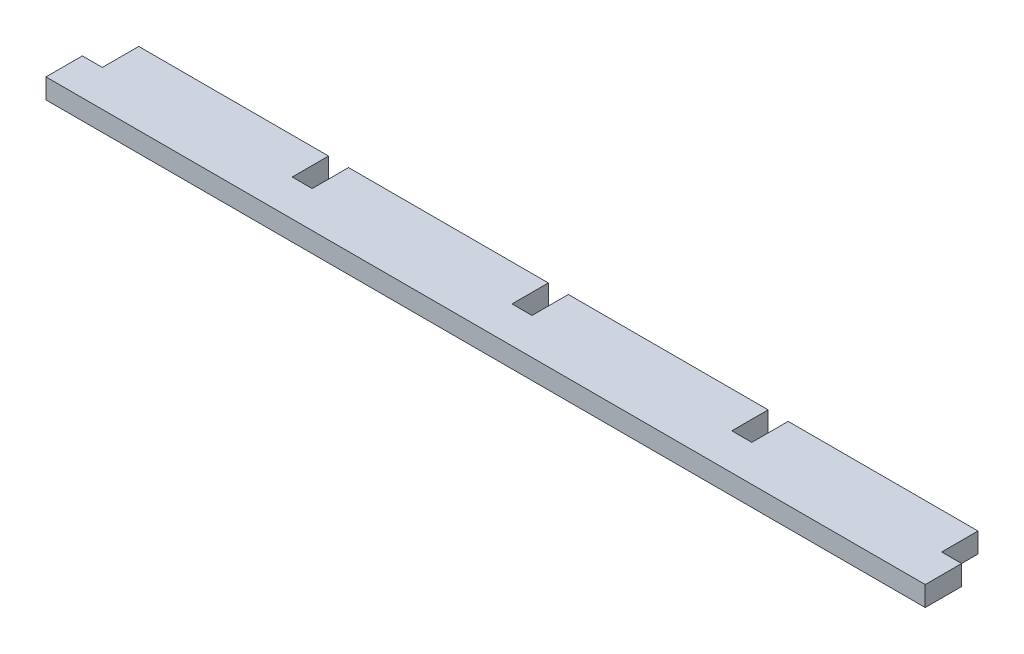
ISO-10303-21;
HEADER;
FILE_DESCRIPTION(('STEP AP214'),'2;1');
FILE_NAME('part.step','',(''),(''),'','','');
FILE_SCHEMA(('AUTOMOTIVE_DESIGN { 1 0 10303 214 1 1 1 1 }'));
ENDSEC;
DATA;
#1=APPLICATION_CONTEXT('core data for automotive mechanical design processes');
#2=APPLICATION_PROTOCOL_DEFINITION('international standard','automotive_design',2000,#1);
#3=PRODUCT_CONTEXT('',#1,'mechanical');
#4=PRODUCT('Part','Part','',(#3));
#5=PRODUCT_RELATED_PRODUCT_CATEGORY('part','',(#4));
#6=PRODUCT_DEFINITION_FORMATION('','',#4);
#7=PRODUCT_DEFINITION_CONTEXT('part definition',#1,'design');
#8=PRODUCT_DEFINITION('design','',#6,#7);
#9=PRODUCT_DEFINITION_SHAPE('','',#8);
#10=(LENGTH_UNIT() NAMED_UNIT(*) SI_UNIT(.MILLI.,.METRE.));
#11=(NAMED_UNIT(*) PLANE_ANGLE_UNIT() SI_UNIT($,.RADIAN.));
#12=(NAMED_UNIT(*) SI_UNIT($,.STERADIAN.) SOLID_ANGLE_UNIT());
#13=UNCERTAINTY_MEASURE_WITH_UNIT(LENGTH_MEASURE(1.E-05),#10,'distance_accuracy_value','');
#14=(GEOMETRIC_REPRESENTATION_CONTEXT(3) GLOBAL_UNCERTAINTY_ASSIGNED_CONTEXT((#13)) GLOBAL_UNIT_ASSIGNED_CONTEXT((#10,
#11,#12)) REPRESENTATION_CONTEXT('',''));
#15=CARTESIAN_POINT('',(0.,0.,0.));
#16=DIRECTION('',(0.,0.,1.));
#17=DIRECTION('',(1.,0.,0.));
#18=AXIS2_PLACEMENT_3D('',#15,#16,#17);
#19=CARTESIAN_POINT('',(-6.35,6.35,0.));
#20=DIRECTION('',(1.,0.,0.));
#21=DIRECTION('',(0.,0.,-1.));
#22=AXIS2_PLACEMENT_3D('',#19,#20,#21);
#23=PLANE('',#22);
#24=DIRECTION('',(0.,0.,1.));
#25=VECTOR('',#24,1.);
#26=CARTESIAN_POINT('',(-6.35,0.,0.));
#27=LINE('',#26,#25);
#28=CARTESIAN_POINT('',(-6.35,0.,-23.114));
#29=VERTEX_POINT('',#28);
#30=CARTESIAN_POINT('',(-6.35,0.,-11.557));
#31=VERTEX_POINT('',#30);
#32=EDGE_CURVE('E202',#29,#31,#27,.T.);
#33=ORIENTED_EDGE('',*,*,#32,.F.);
#34=DIRECTION('',(0.,-1.,0.));
#35=VECTOR('',#34,1.);
#36=CARTESIAN_POINT('',(-6.35,6.35,-23.114));
#37=LINE('',#36,#35);
#38=CARTESIAN_POINT('',(-6.35,6.35,-23.114));
#39=VERTEX_POINT('',#38);
#40=EDGE_CURVE('E11',#39,#29,#37,.T.);
#41=ORIENTED_EDGE('',*,*,#40,.F.);
#42=DIRECTION('',(0.,0.,1.));
#43=VECTOR('',#42,1.);
#44=CARTESIAN_POINT('',(-6.35,6.35,0.));
#45=LINE('',#44,#43);
#46=CARTESIAN_POINT('',(-6.35,6.35,-11.557));
#47=VERTEX_POINT('',#46);
#48=EDGE_CURVE('E250',#39,#47,#45,.T.);
#49=ORIENTED_EDGE('',*,*,#48,.T.);
#50=DIRECTION('',(0.,-1.,0.));
#51=VECTOR('',#50,1.);
#52=CARTESIAN_POINT('',(-6.35,6.35,-11.557));
#53=LINE('',#52,#51);
#54=EDGE_CURVE('E121',#47,#31,#53,.T.);
#55=ORIENTED_EDGE('',*,*,#54,.T.);
#56=EDGE_LOOP('',(#33,#41,#49,#55));
#57=FACE_BOUND('',#56,.T.);
#58=ADVANCED_FACE('F35',(#57),#23,.T.);
#59=CARTESIAN_POINT('',(0.,6.35,-23.114));
#60=DIRECTION('',(0.,0.,1.));
#61=DIRECTION('',(1.,0.,0.));
#62=AXIS2_PLACEMENT_3D('',#59,#60,#61);
#63=PLANE('',#62);
#64=DIRECTION('',(-1.,0.,0.));
#65=VECTOR('',#64,1.);
#66=CARTESIAN_POINT('',(0.,0.,-23.114));
#67=LINE('',#66,#65);
#68=CARTESIAN_POINT('',(-66.675,0.,-23.114));
#69=VERTEX_POINT('',#68);
#70=EDGE_CURVE('E205',#29,#69,#67,.T.);
#71=ORIENTED_EDGE('',*,*,#70,.T.);
#72=DIRECTION('',(0.,-1.,0.));
#73=VECTOR('',#72,1.);
#74=CARTESIAN_POINT('',(-66.675,6.35,-23.114));
#75=LINE('',#74,#73);
#76=CARTESIAN_POINT('',(-66.675,6.35,-23.114));
#77=VERTEX_POINT('',#76);
#78=EDGE_CURVE('E43',#77,#69,#75,.T.);
#79=ORIENTED_EDGE('',*,*,#78,.F.);
#80=DIRECTION('',(-1.,0.,0.));
#81=VECTOR('',#80,1.);
#82=CARTESIAN_POINT('',(0.,6.35,-23.114));
#83=LINE('',#82,#81);
#84=EDGE_CURVE('E310',#39,#77,#83,.T.);
#85=ORIENTED_EDGE('',*,*,#84,.F.);
#86=ORIENTED_EDGE('',*,*,#40,.T.);
#87=EDGE_LOOP('',(#71,#79,#85,#86));
#88=FACE_BOUND('',#87,.T.);
#89=ADVANCED_FACE('F399',(#88),#63,.F.);
#90=CARTESIAN_POINT('',(-66.675,6.35,0.));
#91=DIRECTION('',(1.,0.,0.));
#92=DIRECTION('',(0.,0.,-1.));
#93=AXIS2_PLACEMENT_3D('',#90,#91,#92);
#94=PLANE('',#93);
#95=DIRECTION('',(0.,0.,1.));
#96=VECTOR('',#95,1.);
#97=CARTESIAN_POINT('',(-66.675,0.,0.));
#98=LINE('',#97,#96);
#99=CARTESIAN_POINT('',(-66.675,0.,-11.557));
#100=VERTEX_POINT('',#99);
#101=EDGE_CURVE('E207',#69,#100,#98,.T.);
#102=ORIENTED_EDGE('',*,*,#101,.T.);
#103=DIRECTION('',(0.,-1.,0.));
#104=VECTOR('',#103,1.);
#105=CARTESIAN_POINT('',(-66.675,6.35,-11.557));
#106=LINE('',#105,#104);
#107=CARTESIAN_POINT('',(-66.675,6.35,-11.557));
#108=VERTEX_POINT('',#107);
#109=EDGE_CURVE('E283',#108,#100,#106,.T.);
#110=ORIENTED_EDGE('',*,*,#109,.F.);
#111=DIRECTION('',(0.,0.,1.));
#112=VECTOR('',#111,1.);
#113=CARTESIAN_POINT('',(-66.675,6.35,0.));
#114=LINE('',#113,#112);
#115=EDGE_CURVE('E291',#77,#108,#114,.T.);
#116=ORIENTED_EDGE('',*,*,#115,.F.);
#117=ORIENTED_EDGE('',*,*,#78,.T.);
#118=EDGE_LOOP('',(#102,#110,#116,#117));
#119=FACE_BOUND('',#118,.T.);
#120=ADVANCED_FACE('F289',(#119),#94,.F.);
#121=CARTESIAN_POINT('',(0.,6.35,-11.557));
#122=DIRECTION('',(0.,0.,-1.));
#123=DIRECTION('',(-1.,0.,0.));
#124=AXIS2_PLACEMENT_3D('',#121,#122,#123);
#125=PLANE('',#124);
#126=DIRECTION('',(1.,0.,0.));
#127=VECTOR('',#126,1.);
#128=CARTESIAN_POINT('',(0.,0.,-11.557));
#129=LINE('',#128,#127);
#130=CARTESIAN_POINT('',(-73.025,0.,-11.557));
#131=VERTEX_POINT('',#130);
#132=EDGE_CURVE('E212',#131,#100,#129,.T.);
#133=ORIENTED_EDGE('',*,*,#132,.F.);
#134=DIRECTION('',(0.,-1.,0.));
#135=VECTOR('',#134,1.);
#136=CARTESIAN_POINT('',(-73.025,6.35,-11.557));
#137=LINE('',#136,#135);
#138=CARTESIAN_POINT('',(-73.025,6.35,-11.557));
#139=VERTEX_POINT('',#138);
#140=EDGE_CURVE('E281',#139,#131,#137,.T.);
#141=ORIENTED_EDGE('',*,*,#140,.F.);
#142=DIRECTION('',(1.,0.,0.));
#143=VECTOR('',#142,1.);
#144=CARTESIAN_POINT('',(0.,6.35,-11.557));
#145=LINE('',#144,#143);
#146=EDGE_CURVE('E303',#139,#108,#145,.T.);
#147=ORIENTED_EDGE('',*,*,#146,.T.);
#148=ORIENTED_EDGE('',*,*,#109,.T.);
#149=EDGE_LOOP('',(#133,#141,#147,#148));
#150=FACE_BOUND('',#149,.T.);
#151=ADVANCED_FACE('F300',(#150),#125,.T.);
#152=CARTESIAN_POINT('',(-73.025,6.35,0.));
#153=DIRECTION('',(1.,0.,0.));
#154=DIRECTION('',(0.,0.,-1.));
#155=AXIS2_PLACEMENT_3D('',#152,#153,#154);
#156=PLANE('',#155);
#157=DIRECTION('',(0.,0.,1.));
#158=VECTOR('',#157,1.);
#159=CARTESIAN_POINT('',(-73.025,0.,0.));
#160=LINE('',#159,#158);
#161=CARTESIAN_POINT('',(-73.025,0.,-23.114));
#162=VERTEX_POINT('',#161);
#163=EDGE_CURVE('E215',#162,#131,#160,.T.);
#164=ORIENTED_EDGE('',*,*,#163,.F.);
#165=DIRECTION('',(0.,-1.,0.));
#166=VECTOR('',#165,1.);
#167=CARTESIAN_POINT('',(-73.025,6.35,-23.114));
#168=LINE('',#167,#166);
#169=CARTESIAN_POINT('',(-73.025,6.35,-23.114));
#170=VERTEX_POINT('',#169);
#171=EDGE_CURVE('E279',#170,#162,#168,.T.);
#172=ORIENTED_EDGE('',*,*,#171,.F.);
#173=DIRECTION('',(0.,0.,1.));
#174=VECTOR('',#173,1.);
#175=CARTESIAN_POINT('',(-73.025,6.35,0.));
#176=LINE('',#175,#174);
#177=EDGE_CURVE('E306',#170,#139,#176,.T.);
#178=ORIENTED_EDGE('',*,*,#177,.T.);
#179=ORIENTED_EDGE('',*,*,#140,.T.);
#180=EDGE_LOOP('',(#164,#172,#178,#179));
#181=FACE_BOUND('',#180,.T.);
#182=ADVANCED_FACE('F409',(#181),#156,.T.);
#183=CARTESIAN_POINT('',(-136.525,0.,-23.114));
#184=VERTEX_POINT('',#183);
#185=EDGE_CURVE('E209',#162,#184,#67,.T.);
#186=ORIENTED_EDGE('',*,*,#185,.T.);
#187=DIRECTION('',(0.,-1.,0.));
#188=VECTOR('',#187,1.);
#189=CARTESIAN_POINT('',(-136.525,6.35,-23.114));
#190=LINE('',#189,#188);
#191=CARTESIAN_POINT('',(-136.525,6.35,-23.114));
#192=VERTEX_POINT('',#191);
#193=EDGE_CURVE('E276',#192,#184,#190,.T.);
#194=ORIENTED_EDGE('',*,*,#193,.F.);
#195=EDGE_CURVE('E308',#170,#192,#83,.T.);
#196=ORIENTED_EDGE('',*,*,#195,.F.);
#197=ORIENTED_EDGE('',*,*,#171,.T.);
#198=EDGE_LOOP('',(#186,#194,#196,#197));
#199=FACE_BOUND('',#198,.T.);
#200=ADVANCED_FACE('F377',(#199),#63,.F.);
#201=CARTESIAN_POINT('',(-136.525,6.35,0.));
#202=DIRECTION('',(1.,0.,0.));
#203=DIRECTION('',(0.,0.,-1.));
#204=AXIS2_PLACEMENT_3D('',#201,#202,#203);
#205=PLANE('',#204);
#206=DIRECTION('',(0.,0.,1.));
#207=VECTOR('',#206,1.);
#208=CARTESIAN_POINT('',(-136.525,0.,0.));
#209=LINE('',#208,#207);
#210=CARTESIAN_POINT('',(-136.525,0.,-11.557));
#211=VERTEX_POINT('',#210);
#212=EDGE_CURVE('E218',#184,#211,#209,.T.);
#213=ORIENTED_EDGE('',*,*,#212,.T.);
#214=DIRECTION('',(0.,-1.,0.));
#215=VECTOR('',#214,1.);
#216=CARTESIAN_POINT('',(-136.525,6.35,-11.557));
#217=LINE('',#216,#215);
#218=CARTESIAN_POINT('',(-136.525,6.35,-11.557));
#219=VERTEX_POINT('',#218);
#220=EDGE_CURVE('E274',#219,#211,#217,.T.);
#221=ORIENTED_EDGE('',*,*,#220,.F.);
#222=DIRECTION('',(0.,0.,1.));
#223=VECTOR('',#222,1.);
#224=CARTESIAN_POINT('',(-136.525,6.35,0.));
#225=LINE('',#224,#223);
#226=EDGE_CURVE('E314',#192,#219,#225,.T.);
#227=ORIENTED_EDGE('',*,*,#226,.F.);
#228=ORIENTED_EDGE('',*,*,#193,.T.);
#229=EDGE_LOOP('',(#213,#221,#227,#228));
#230=FACE_BOUND('',#229,.T.);
#231=ADVANCED_FACE('F381',(#230),#205,.F.);
#232=CARTESIAN_POINT('',(0.,6.35,-11.557));
#233=DIRECTION('',(0.,0.,-1.));
#234=DIRECTION('',(-1.,0.,0.));
#235=AXIS2_PLACEMENT_3D('',#232,#233,#234);
#236=PLANE('',#235);
#237=DIRECTION('',(1.,0.,0.));
#238=VECTOR('',#237,1.);
#239=CARTESIAN_POINT('',(0.,0.,-11.557));
#240=LINE('',#239,#238);
#241=CARTESIAN_POINT('',(-142.875,0.,-11.557));
#242=VERTEX_POINT('',#241);
#243=EDGE_CURVE('E221',#242,#211,#240,.T.);
#244=ORIENTED_EDGE('',*,*,#243,.F.);
#245=DIRECTION('',(0.,-1.,0.));
#246=VECTOR('',#245,1.);
#247=CARTESIAN_POINT('',(-142.875,6.35,-11.557));
#248=LINE('',#247,#246);
#249=CARTESIAN_POINT('',(-142.875,6.35,-11.557));
#250=VERTEX_POINT('',#249);
#251=EDGE_CURVE('E272',#250,#242,#248,.T.);
#252=ORIENTED_EDGE('',*,*,#251,.F.);
#253=DIRECTION('',(1.,0.,0.));
#254=VECTOR('',#253,1.);
#255=CARTESIAN_POINT('',(0.,6.35,-11.557));
#256=LINE('',#255,#254);
#257=EDGE_CURVE('E316',#250,#219,#256,.T.);
#258=ORIENTED_EDGE('',*,*,#257,.T.);
#259=ORIENTED_EDGE('',*,*,#220,.T.);
#260=EDGE_LOOP('',(#244,#252,#258,#259));
#261=FACE_BOUND('',#260,.T.);
#262=ADVANCED_FACE('F386',(#261),#236,.T.);
#263=CARTESIAN_POINT('',(-142.875,6.35,0.));
#264=DIRECTION('',(1.,0.,0.));
#265=DIRECTION('',(0.,0.,-1.));
#266=AXIS2_PLACEMENT_3D('',#263,#264,#265);
#267=PLANE('',#266);
#268=DIRECTION('',(0.,0.,1.));
#269=VECTOR('',#268,1.);
#270=CARTESIAN_POINT('',(-142.875,0.,0.));
#271=LINE('',#270,#269);
#272=CARTESIAN_POINT('',(-142.875,0.,-23.114));
#273=VERTEX_POINT('',#272);
#274=EDGE_CURVE('E224',#273,#242,#271,.T.);
#275=ORIENTED_EDGE('',*,*,#274,.F.);
#276=DIRECTION('',(0.,-1.,0.));
#277=VECTOR('',#276,1.);
#278=CARTESIAN_POINT('',(-142.875,6.35,-23.114));
#279=LINE('',#278,#277);
#280=CARTESIAN_POINT('',(-142.875,6.35,-23.114));
#281=VERTEX_POINT('',#280);
#282=EDGE_CURVE('E270',#281,#273,#279,.T.);
#283=ORIENTED_EDGE('',*,*,#282,.F.);
#284=DIRECTION('',(0.,0.,1.));
#285=VECTOR('',#284,1.);
#286=CARTESIAN_POINT('',(-142.875,6.35,0.));
#287=LINE('',#286,#285);
#288=EDGE_CURVE('E319',#281,#250,#287,.T.);
#289=ORIENTED_EDGE('',*,*,#288,.T.);
#290=ORIENTED_EDGE('',*,*,#251,.T.);
#291=EDGE_LOOP('',(#275,#283,#289,#290));
#292=FACE_BOUND('',#291,.T.);
#293=ADVANCED_FACE('F388',(#292),#267,.T.);
#294=CARTESIAN_POINT('',(-206.375,0.,-23.114));
#295=VERTEX_POINT('',#294);
#296=EDGE_CURVE('E227',#273,#295,#67,.T.);
#297=ORIENTED_EDGE('',*,*,#296,.T.);
#298=DIRECTION('',(0.,-1.,0.));
#299=VECTOR('',#298,1.);
#300=CARTESIAN_POINT('',(-206.375,6.35,-23.114));
#301=LINE('',#300,#299);
#302=CARTESIAN_POINT('',(-206.375,6.35,-23.114));
#303=VERTEX_POINT('',#302);
#304=EDGE_CURVE('E267',#303,#295,#301,.T.);
#305=ORIENTED_EDGE('',*,*,#304,.F.);
#306=EDGE_CURVE('E322',#281,#303,#83,.T.);
#307=ORIENTED_EDGE('',*,*,#306,.F.);
#308=ORIENTED_EDGE('',*,*,#282,.T.);
#309=EDGE_LOOP('',(#297,#305,#307,#308));
#310=FACE_BOUND('',#309,.T.);
#311=ADVANCED_FACE('F356',(#310),#63,.F.);
#312=CARTESIAN_POINT('',(-206.375,6.35,0.));
#313=DIRECTION('',(1.,0.,0.));
#314=DIRECTION('',(0.,0.,-1.));
#315=AXIS2_PLACEMENT_3D('',#312,#313,#314);
#316=PLANE('',#315);
#317=DIRECTION('',(0.,0.,1.));
#318=VECTOR('',#317,1.);
#319=CARTESIAN_POINT('',(-206.375,0.,0.));
#320=LINE('',#319,#318);
#321=CARTESIAN_POINT('',(-206.375,0.,-11.557));
#322=VERTEX_POINT('',#321);
#323=EDGE_CURVE('E228',#295,#322,#320,.T.);
#324=ORIENTED_EDGE('',*,*,#323,.T.);
#325=DIRECTION('',(0.,-1.,0.));
#326=VECTOR('',#325,1.);
#327=CARTESIAN_POINT('',(-206.375,6.35,-11.557));
#328=LINE('',#327,#326);
#329=CARTESIAN_POINT('',(-206.375,6.35,-11.557));
#330=VERTEX_POINT('',#329);
#331=EDGE_CURVE('E265',#330,#322,#328,.T.);
#332=ORIENTED_EDGE('',*,*,#331,.F.);
#333=DIRECTION('',(0.,0.,1.));
#334=VECTOR('',#333,1.);
#335=CARTESIAN_POINT('',(-206.375,6.35,0.));
#336=LINE('',#335,#334);
#337=EDGE_CURVE('E323',#303,#330,#336,.T.);
#338=ORIENTED_EDGE('',*,*,#337,.F.);
#339=ORIENTED_EDGE('',*,*,#304,.T.);
#340=EDGE_LOOP('',(#324,#332,#338,#339));
#341=FACE_BOUND('',#340,.T.);
#342=ADVANCED_FACE('F360',(#341),#316,.F.);
#343=CARTESIAN_POINT('',(0.,6.35,-11.557));
#344=DIRECTION('',(0.,0.,-1.));
#345=DIRECTION('',(-1.,0.,0.));
#346=AXIS2_PLACEMENT_3D('',#343,#344,#345);
#347=PLANE('',#346);
#348=DIRECTION('',(1.,0.,0.));
#349=VECTOR('',#348,1.);
#350=CARTESIAN_POINT('',(0.,0.,-11.557));
#351=LINE('',#350,#349);
#352=CARTESIAN_POINT('',(-212.725,0.,-11.557));
#353=VERTEX_POINT('',#352);
#354=EDGE_CURVE('E231',#353,#322,#351,.T.);
#355=ORIENTED_EDGE('',*,*,#354,.F.);
#356=DIRECTION('',(0.,-1.,0.));
#357=VECTOR('',#356,1.);
#358=CARTESIAN_POINT('',(-212.725,6.35,-11.557));
#359=LINE('',#358,#357);
#360=CARTESIAN_POINT('',(-212.725,6.35,-11.557));
#361=VERTEX_POINT('',#360);
#362=EDGE_CURVE('E263',#361,#353,#359,.T.);
#363=ORIENTED_EDGE('',*,*,#362,.F.);
#364=DIRECTION('',(1.,0.,0.));
#365=VECTOR('',#364,1.);
#366=CARTESIAN_POINT('',(0.,6.35,-11.557));
#367=LINE('',#366,#365);
#368=EDGE_CURVE('E325',#361,#330,#367,.T.);
#369=ORIENTED_EDGE('',*,*,#368,.T.);
#370=ORIENTED_EDGE('',*,*,#331,.T.);
#371=EDGE_LOOP('',(#355,#363,#369,#370));
#372=FACE_BOUND('',#371,.T.);
#373=ADVANCED_FACE('F363',(#372),#347,.T.);
#374=CARTESIAN_POINT('',(-212.725,6.35,0.));
#375=DIRECTION('',(1.,0.,0.));
#376=DIRECTION('',(0.,0.,-1.));
#377=AXIS2_PLACEMENT_3D('',#374,#375,#376);
#378=PLANE('',#377);
#379=DIRECTION('',(0.,0.,1.));
#380=VECTOR('',#379,1.);
#381=CARTESIAN_POINT('',(-212.725,0.,0.));
#382=LINE('',#381,#380);
#383=CARTESIAN_POINT('',(-212.725,0.,-23.114));
#384=VERTEX_POINT('',#383);
#385=EDGE_CURVE('E234',#384,#353,#382,.T.);
#386=ORIENTED_EDGE('',*,*,#385,.F.);
#387=DIRECTION('',(0.,-1.,0.));
#388=VECTOR('',#387,1.);
#389=CARTESIAN_POINT('',(-212.725,6.35,-23.114));
#390=LINE('',#389,#388);
#391=CARTESIAN_POINT('',(-212.725,6.35,-23.114));
#392=VERTEX_POINT('',#391);
#393=EDGE_CURVE('E261',#392,#384,#390,.T.);
#394=ORIENTED_EDGE('',*,*,#393,.F.);
#395=DIRECTION('',(0.,0.,1.));
#396=VECTOR('',#395,1.);
#397=CARTESIAN_POINT('',(-212.725,6.35,0.));
#398=LINE('',#397,#396);
#399=EDGE_CURVE('E328',#392,#361,#398,.T.);
#400=ORIENTED_EDGE('',*,*,#399,.T.);
#401=ORIENTED_EDGE('',*,*,#362,.T.);
#402=EDGE_LOOP('',(#386,#394,#400,#401));
#403=FACE_BOUND('',#402,.T.);
#404=ADVANCED_FACE('F367',(#403),#378,.T.);
#405=CARTESIAN_POINT('',(-273.05,0.,-23.114));
#406=VERTEX_POINT('',#405);
#407=EDGE_CURVE('E208',#384,#406,#67,.T.);
#408=ORIENTED_EDGE('',*,*,#407,.T.);
#409=DIRECTION('',(0.,-1.,0.));
#410=VECTOR('',#409,1.);
#411=CARTESIAN_POINT('',(-273.05,6.35,-23.114));
#412=LINE('',#411,#410);
#413=CARTESIAN_POINT('',(-273.05,6.35,-23.114));
#414=VERTEX_POINT('',#413);
#415=EDGE_CURVE('E258',#414,#406,#412,.T.);
#416=ORIENTED_EDGE('',*,*,#415,.F.);
#417=EDGE_CURVE('E331',#392,#414,#83,.T.);
#418=ORIENTED_EDGE('',*,*,#417,.F.);
#419=ORIENTED_EDGE('',*,*,#393,.T.);
#420=EDGE_LOOP('',(#408,#416,#418,#419));
#421=FACE_BOUND('',#420,.T.);
#422=ADVANCED_FACE('F372',(#421),#63,.F.);
#423=CARTESIAN_POINT('',(-273.05,6.35,0.));
#424=DIRECTION('',(1.,0.,0.));
#425=DIRECTION('',(0.,0.,-1.));
#426=AXIS2_PLACEMENT_3D('',#423,#424,#425);
#427=PLANE('',#426);
#428=DIRECTION('',(0.,0.,1.));
#429=VECTOR('',#428,1.);
#430=CARTESIAN_POINT('',(-273.05,0.,0.));
#431=LINE('',#430,#429);
#432=CARTESIAN_POINT('',(-273.05,0.,-11.557));
#433=VERTEX_POINT('',#432);
#434=EDGE_CURVE('E237',#406,#433,#431,.T.);
#435=ORIENTED_EDGE('',*,*,#434,.T.);
#436=DIRECTION('',(0.,-1.,0.));
#437=VECTOR('',#436,1.);
#438=CARTESIAN_POINT('',(-273.05,6.35,-11.557));
#439=LINE('',#438,#437);
#440=CARTESIAN_POINT('',(-273.05,6.35,-11.557));
#441=VERTEX_POINT('',#440);
#442=EDGE_CURVE('E256',#441,#433,#439,.T.);
#443=ORIENTED_EDGE('',*,*,#442,.F.);
#444=DIRECTION('',(0.,0.,1.));
#445=VECTOR('',#444,1.);
#446=CARTESIAN_POINT('',(-273.05,6.35,0.));
#447=LINE('',#446,#445);
#448=EDGE_CURVE('E332',#414,#441,#447,.T.);
#449=ORIENTED_EDGE('',*,*,#448,.F.);
#450=ORIENTED_EDGE('',*,*,#415,.T.);
#451=EDGE_LOOP('',(#435,#443,#449,#450));
#452=FACE_BOUND('',#451,.T.);
#453=ADVANCED_FACE('F375',(#452),#427,.F.);
#454=CARTESIAN_POINT('',(0.,6.35,-11.557));
#455=DIRECTION('',(0.,0.,-1.));
#456=DIRECTION('',(-1.,0.,0.));
#457=AXIS2_PLACEMENT_3D('',#454,#455,#456);
#458=PLANE('',#457);
#459=DIRECTION('',(1.,0.,0.));
#460=VECTOR('',#459,1.);
#461=CARTESIAN_POINT('',(0.,0.,-11.557));
#462=LINE('',#461,#460);
#463=CARTESIAN_POINT('',(-279.4,0.,-11.557));
#464=VERTEX_POINT('',#463);
#465=EDGE_CURVE('E240',#464,#433,#462,.T.);
#466=ORIENTED_EDGE('',*,*,#465,.F.);
#467=DIRECTION('',(0.,-1.,0.));
#468=VECTOR('',#467,1.);
#469=CARTESIAN_POINT('',(-279.4,6.35,-11.557));
#470=LINE('',#469,#468);
#471=CARTESIAN_POINT('',(-279.4,6.35,-11.557));
#472=VERTEX_POINT('',#471);
#473=EDGE_CURVE('E254',#472,#464,#470,.T.);
#474=ORIENTED_EDGE('',*,*,#473,.F.);
#475=DIRECTION('',(1.,0.,0.));
#476=VECTOR('',#475,1.);
#477=CARTESIAN_POINT('',(0.,6.35,-11.557));
#478=LINE('',#477,#476);
#479=EDGE_CURVE('E197',#472,#441,#478,.T.);
#480=ORIENTED_EDGE('',*,*,#479,.T.);
#481=ORIENTED_EDGE('',*,*,#442,.T.);
#482=EDGE_LOOP('',(#466,#474,#480,#481));
#483=FACE_BOUND('',#482,.T.);
#484=ADVANCED_FACE('F336',(#483),#458,.T.);
#485=CARTESIAN_POINT('',(-279.4,6.35,0.));
#486=DIRECTION('',(-1.,0.,0.));
#487=DIRECTION('',(0.,0.,1.));
#488=AXIS2_PLACEMENT_3D('',#485,#486,#487);
#489=PLANE('',#488);
#490=DIRECTION('',(0.,0.,-1.));
#491=VECTOR('',#490,1.);
#492=CARTESIAN_POINT('',(-279.4,0.,0.));
#493=LINE('',#492,#491);
#494=CARTESIAN_POINT('',(-279.4,0.,0.));
#495=VERTEX_POINT('',#494);
#496=EDGE_CURVE('E243',#495,#464,#493,.T.);
#497=ORIENTED_EDGE('',*,*,#496,.F.);
#498=DIRECTION('',(0.,-1.,0.));
#499=VECTOR('',#498,1.);
#500=CARTESIAN_POINT('',(-279.4,6.35,0.));
#501=LINE('',#500,#499);
#502=CARTESIAN_POINT('',(-279.4,6.35,0.));
#503=VERTEX_POINT('',#502);
#504=EDGE_CURVE('E185',#503,#495,#501,.T.);
#505=ORIENTED_EDGE('',*,*,#504,.F.);
#506=DIRECTION('',(0.,0.,-1.));
#507=VECTOR('',#506,1.);
#508=CARTESIAN_POINT('',(-279.4,6.35,0.));
#509=LINE('',#508,#507);
#510=EDGE_CURVE('E195',#503,#472,#509,.T.);
#511=ORIENTED_EDGE('',*,*,#510,.T.);
#512=ORIENTED_EDGE('',*,*,#473,.T.);
#513=EDGE_LOOP('',(#497,#505,#511,#512));
#514=FACE_BOUND('',#513,.T.);
#515=ADVANCED_FACE('F341',(#514),#489,.T.);
#516=CARTESIAN_POINT('',(0.,6.35,0.));
#517=DIRECTION('',(0.,0.,1.));
#518=DIRECTION('',(1.,0.,0.));
#519=AXIS2_PLACEMENT_3D('',#516,#517,#518);
#520=PLANE('',#519);
#521=DIRECTION('',(-1.,0.,0.));
#522=VECTOR('',#521,1.);
#523=CARTESIAN_POINT('',(0.,0.,0.));
#524=LINE('',#523,#522);
#525=CARTESIAN_POINT('',(0.,0.,0.));
#526=VERTEX_POINT('',#525);
#527=EDGE_CURVE('E184',#526,#495,#524,.T.);
#528=ORIENTED_EDGE('',*,*,#527,.F.);
#529=DIRECTION('',(0.,-1.,0.));
#530=VECTOR('',#529,1.);
#531=CARTESIAN_POINT('',(0.,6.35,0.));
#532=LINE('',#531,#530);
#533=CARTESIAN_POINT('',(0.,6.35,0.));
#534=VERTEX_POINT('',#533);
#535=EDGE_CURVE('E178',#534,#526,#532,.T.);
#536=ORIENTED_EDGE('',*,*,#535,.F.);
#537=DIRECTION('',(-1.,0.,0.));
#538=VECTOR('',#537,1.);
#539=CARTESIAN_POINT('',(0.,6.35,0.));
#540=LINE('',#539,#538);
#541=EDGE_CURVE('E182',#534,#503,#540,.T.);
#542=ORIENTED_EDGE('',*,*,#541,.T.);
#543=ORIENTED_EDGE('',*,*,#504,.T.);
#544=EDGE_LOOP('',(#528,#536,#542,#543));
#545=FACE_BOUND('',#544,.T.);
#546=ADVANCED_FACE('F180',(#545),#520,.T.);
#547=CARTESIAN_POINT('',(0.,6.35,0.));
#548=DIRECTION('',(-1.,0.,0.));
#549=DIRECTION('',(0.,0.,1.));
#550=AXIS2_PLACEMENT_3D('',#547,#548,#549);
#551=PLANE('',#550);
#552=DIRECTION('',(0.,0.,-1.));
#553=VECTOR('',#552,1.);
#554=CARTESIAN_POINT('',(0.,0.,0.));
#555=LINE('',#554,#553);
#556=CARTESIAN_POINT('',(0.,0.,-11.557));
#557=VERTEX_POINT('',#556);
#558=EDGE_CURVE('E114',#526,#557,#555,.T.);
#559=ORIENTED_EDGE('',*,*,#558,.T.);
#560=DIRECTION('',(0.,-1.,0.));
#561=VECTOR('',#560,1.);
#562=CARTESIAN_POINT('',(0.,6.35,-11.557));
#563=LINE('',#562,#561);
#564=CARTESIAN_POINT('',(0.,6.35,-11.557));
#565=VERTEX_POINT('',#564);
#566=EDGE_CURVE('E186',#565,#557,#563,.T.);
#567=ORIENTED_EDGE('',*,*,#566,.F.);
#568=DIRECTION('',(0.,0.,-1.));
#569=VECTOR('',#568,1.);
#570=CARTESIAN_POINT('',(0.,6.35,0.));
#571=LINE('',#570,#569);
#572=EDGE_CURVE('E188',#534,#565,#571,.T.);
#573=ORIENTED_EDGE('',*,*,#572,.F.);
#574=ORIENTED_EDGE('',*,*,#535,.T.);
#575=EDGE_LOOP('',(#559,#567,#573,#574));
#576=FACE_BOUND('',#575,.T.);
#577=ADVANCED_FACE('F189',(#576),#551,.F.);
#578=CARTESIAN_POINT('',(0.,6.35,-11.557));
#579=DIRECTION('',(0.,0.,1.));
#580=DIRECTION('',(1.,0.,0.));
#581=AXIS2_PLACEMENT_3D('',#578,#579,#580);
#582=PLANE('',#581);
#583=DIRECTION('',(-1.,0.,0.));
#584=VECTOR('',#583,1.);
#585=CARTESIAN_POINT('',(0.,0.,-11.557));
#586=LINE('',#585,#584);
#587=EDGE_CURVE('E248',#557,#31,#586,.T.);
#588=ORIENTED_EDGE('',*,*,#587,.T.);
#589=ORIENTED_EDGE('',*,*,#54,.F.);
#590=DIRECTION('',(-1.,0.,0.));
#591=VECTOR('',#590,1.);
#592=CARTESIAN_POINT('',(0.,6.35,-11.557));
#593=LINE('',#592,#591);
#594=EDGE_CURVE('E51',#565,#47,#593,.T.);
#595=ORIENTED_EDGE('',*,*,#594,.F.);
#596=ORIENTED_EDGE('',*,*,#566,.T.);
#597=EDGE_LOOP('',(#588,#589,#595,#596));
#598=FACE_BOUND('',#597,.T.);
#599=ADVANCED_FACE('F344',(#598),#582,.F.);
#600=CARTESIAN_POINT('',(0.,6.35,0.));
#601=DIRECTION('',(0.,1.,0.));
#602=DIRECTION('',(0.,0.,1.));
#603=AXIS2_PLACEMENT_3D('',#600,#601,#602);
#604=PLANE('',#603);
#605=ORIENTED_EDGE('',*,*,#48,.F.);
#606=ORIENTED_EDGE('',*,*,#84,.T.);
#607=ORIENTED_EDGE('',*,*,#115,.T.);
#608=ORIENTED_EDGE('',*,*,#146,.F.);
#609=ORIENTED_EDGE('',*,*,#177,.F.);
#610=ORIENTED_EDGE('',*,*,#195,.T.);
#611=ORIENTED_EDGE('',*,*,#226,.T.);
#612=ORIENTED_EDGE('',*,*,#257,.F.);
#613=ORIENTED_EDGE('',*,*,#288,.F.);
#614=ORIENTED_EDGE('',*,*,#306,.T.);
#615=ORIENTED_EDGE('',*,*,#337,.T.);
#616=ORIENTED_EDGE('',*,*,#368,.F.);
#617=ORIENTED_EDGE('',*,*,#399,.F.);
#618=ORIENTED_EDGE('',*,*,#417,.T.);
#619=ORIENTED_EDGE('',*,*,#448,.T.);
#620=ORIENTED_EDGE('',*,*,#479,.F.);
#621=ORIENTED_EDGE('',*,*,#510,.F.);
#622=ORIENTED_EDGE('',*,*,#541,.F.);
#623=ORIENTED_EDGE('',*,*,#572,.T.);
#624=ORIENTED_EDGE('',*,*,#594,.T.);
#625=EDGE_LOOP('',(#605,#606,#607,#608,#609,#610,#611,#612,#613,#614,#615,#616,#617,#618,#619,
#620,#621,#622,#623,#624));
#626=FACE_BOUND('',#625,.T.);
#627=ADVANCED_FACE('F192',(#626),#604,.T.);
#628=CARTESIAN_POINT('',(0.,0.,0.));
#629=DIRECTION('',(0.,1.,0.));
#630=DIRECTION('',(0.,0.,1.));
#631=AXIS2_PLACEMENT_3D('',#628,#629,#630);
#632=PLANE('',#631);
#633=ORIENTED_EDGE('',*,*,#32,.T.);
#634=ORIENTED_EDGE('',*,*,#587,.F.);
#635=ORIENTED_EDGE('',*,*,#558,.F.);
#636=ORIENTED_EDGE('',*,*,#527,.T.);
#637=ORIENTED_EDGE('',*,*,#496,.T.);
#638=ORIENTED_EDGE('',*,*,#465,.T.);
#639=ORIENTED_EDGE('',*,*,#434,.F.);
#640=ORIENTED_EDGE('',*,*,#407,.F.);
#641=ORIENTED_EDGE('',*,*,#385,.T.);
#642=ORIENTED_EDGE('',*,*,#354,.T.);
#643=ORIENTED_EDGE('',*,*,#323,.F.);
#644=ORIENTED_EDGE('',*,*,#296,.F.);
#645=ORIENTED_EDGE('',*,*,#274,.T.);
#646=ORIENTED_EDGE('',*,*,#243,.T.);
#647=ORIENTED_EDGE('',*,*,#212,.F.);
#648=ORIENTED_EDGE('',*,*,#185,.F.);
#649=ORIENTED_EDGE('',*,*,#163,.T.);
#650=ORIENTED_EDGE('',*,*,#132,.T.);
#651=ORIENTED_EDGE('',*,*,#101,.F.);
#652=ORIENTED_EDGE('',*,*,#70,.F.);
#653=EDGE_LOOP('',(#633,#634,#635,#636,#637,#638,#639,#640,#641,#642,#643,#644,#645,#646,#647,
#648,#649,#650,#651,#652));
#654=FACE_BOUND('',#653,.T.);
#655=ADVANCED_FACE('F295',(#654),#632,.F.);
#656=CLOSED_SHELL('',(#58,#89,#120,#151,#182,#200,#231,#262,#293,#311,#342,#373,#404,#422,#453,
#484,#515,#546,#577,#599,#627,#655));
#657=MANIFOLD_SOLID_BREP('B2',#656);
#658=ADVANCED_BREP_SHAPE_REPRESENTATION('',(#18,#657),#14);
#659=SHAPE_DEFINITION_REPRESENTATION(#9,#658);
ENDSEC;
END-ISO-10303-21;
